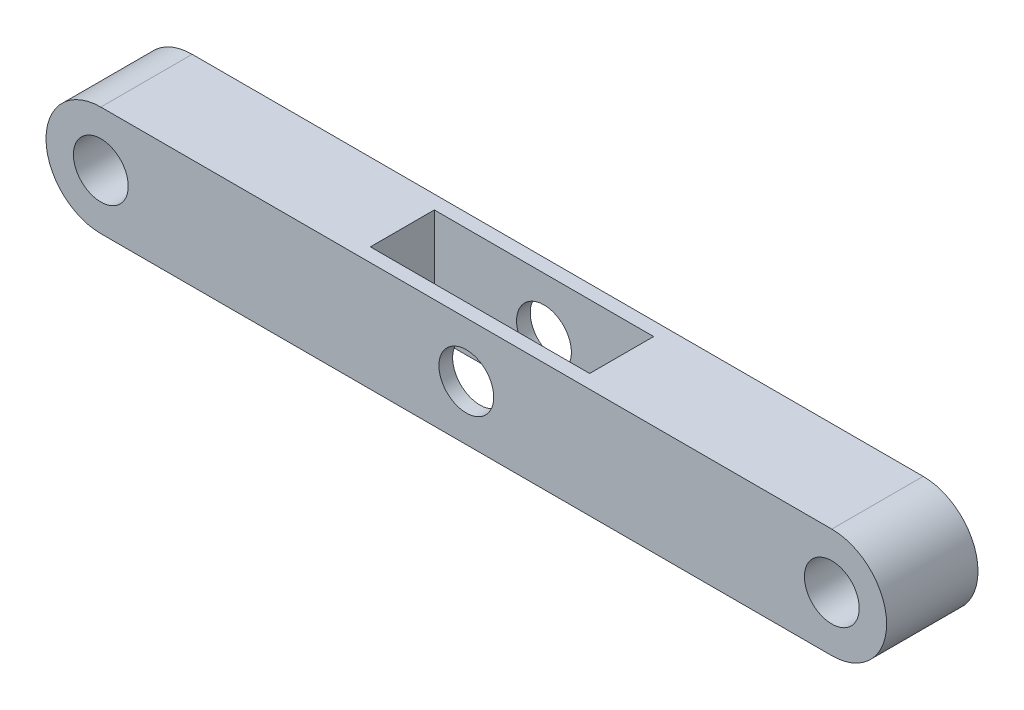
ISO-10303-21;
HEADER;
FILE_DESCRIPTION(('STEP AP214'),'2;1');
FILE_NAME('part.step','',(''),(''),'','','');
FILE_SCHEMA(('AUTOMOTIVE_DESIGN { 1 0 10303 214 1 1 1 1 }'));
ENDSEC;
DATA;
#1=APPLICATION_CONTEXT('core data for automotive mechanical design processes');
#2=APPLICATION_PROTOCOL_DEFINITION('international standard','automotive_design',2000,#1);
#3=PRODUCT_CONTEXT('',#1,'mechanical');
#4=PRODUCT('Part','Part','',(#3));
#5=PRODUCT_RELATED_PRODUCT_CATEGORY('part','',(#4));
#6=PRODUCT_DEFINITION_FORMATION('','',#4);
#7=PRODUCT_DEFINITION_CONTEXT('part definition',#1,'design');
#8=PRODUCT_DEFINITION('design','',#6,#7);
#9=PRODUCT_DEFINITION_SHAPE('','',#8);
#10=(LENGTH_UNIT() NAMED_UNIT(*) SI_UNIT(.MILLI.,.METRE.));
#11=(NAMED_UNIT(*) PLANE_ANGLE_UNIT() SI_UNIT($,.RADIAN.));
#12=(NAMED_UNIT(*) SI_UNIT($,.STERADIAN.) SOLID_ANGLE_UNIT());
#13=UNCERTAINTY_MEASURE_WITH_UNIT(LENGTH_MEASURE(1.E-05),#10,'distance_accuracy_value','');
#14=(GEOMETRIC_REPRESENTATION_CONTEXT(3) GLOBAL_UNCERTAINTY_ASSIGNED_CONTEXT((#13)) GLOBAL_UNIT_ASSIGNED_CONTEXT((#10,
#11,#12)) REPRESENTATION_CONTEXT('',''));
#15=CARTESIAN_POINT('',(0.,0.,0.));
#16=DIRECTION('',(0.,0.,1.));
#17=DIRECTION('',(1.,0.,0.));
#18=AXIS2_PLACEMENT_3D('',#15,#16,#17);
#19=CARTESIAN_POINT('',(0.,0.,5.));
#20=DIRECTION('',(0.,0.,-1.));
#21=DIRECTION('',(-1.,0.,0.));
#22=AXIS2_PLACEMENT_3D('',#19,#20,#21);
#23=PLANE('',#22);
#24=CARTESIAN_POINT('',(40.,0.,5.));
#25=DIRECTION('',(0.,0.,1.));
#26=DIRECTION('',(1.,0.,0.));
#27=AXIS2_PLACEMENT_3D('',#24,#25,#26);
#28=CIRCLE('',#27,3.);
#29=CARTESIAN_POINT('',(43.,0.,5.));
#30=VERTEX_POINT('',#29);
#31=EDGE_CURVE('E252',#30,#30,#28,.T.);
#32=ORIENTED_EDGE('',*,*,#31,.F.);
#33=EDGE_LOOP('',(#32));
#34=FACE_BOUND('',#33,.T.);
#35=CARTESIAN_POINT('',(0.,0.,5.));
#36=DIRECTION('',(0.,0.,1.));
#37=DIRECTION('',(1.,0.,0.));
#38=AXIS2_PLACEMENT_3D('',#35,#36,#37);
#39=CIRCLE('',#38,3.);
#40=CARTESIAN_POINT('',(3.,0.,5.));
#41=VERTEX_POINT('',#40);
#42=EDGE_CURVE('E133',#41,#41,#39,.T.);
#43=ORIENTED_EDGE('',*,*,#42,.F.);
#44=EDGE_LOOP('',(#43));
#45=FACE_BOUND('',#44,.T.);
#46=CARTESIAN_POINT('',(0.,0.,5.));
#47=DIRECTION('',(0.,0.,1.));
#48=DIRECTION('',(-1.,0.,0.));
#49=AXIS2_PLACEMENT_3D('',#46,#47,#48);
#50=CIRCLE('',#49,6.);
#51=CARTESIAN_POINT('',(0.,6.,5.));
#52=VERTEX_POINT('',#51);
#53=CARTESIAN_POINT('',(0.,-6.,5.));
#54=VERTEX_POINT('',#53);
#55=EDGE_CURVE('E145',#52,#54,#50,.T.);
#56=ORIENTED_EDGE('',*,*,#55,.T.);
#57=DIRECTION('',(1.,0.,0.));
#58=VECTOR('',#57,1.);
#59=CARTESIAN_POINT('',(0.,-6.,5.));
#60=LINE('',#59,#58);
#61=CARTESIAN_POINT('',(80.,-6.,5.));
#62=VERTEX_POINT('',#61);
#63=EDGE_CURVE('E148',#54,#62,#60,.T.);
#64=ORIENTED_EDGE('',*,*,#63,.T.);
#65=CARTESIAN_POINT('',(80.,0.,5.));
#66=DIRECTION('',(0.,0.,1.));
#67=DIRECTION('',(1.,0.,0.));
#68=AXIS2_PLACEMENT_3D('',#65,#66,#67);
#69=CIRCLE('',#68,6.);
#70=CARTESIAN_POINT('',(80.,6.,5.));
#71=VERTEX_POINT('',#70);
#72=EDGE_CURVE('E150',#62,#71,#69,.T.);
#73=ORIENTED_EDGE('',*,*,#72,.T.);
#74=DIRECTION('',(-1.,0.,0.));
#75=VECTOR('',#74,1.);
#76=CARTESIAN_POINT('',(0.,6.,5.));
#77=LINE('',#76,#75);
#78=EDGE_CURVE('E152',#71,#52,#77,.T.);
#79=ORIENTED_EDGE('',*,*,#78,.T.);
#80=EDGE_LOOP('',(#56,#64,#73,#79));
#81=FACE_BOUND('',#80,.T.);
#82=CARTESIAN_POINT('',(80.,0.,5.));
#83=DIRECTION('',(0.,0.,1.));
#84=DIRECTION('',(1.,0.,0.));
#85=AXIS2_PLACEMENT_3D('',#82,#83,#84);
#86=CIRCLE('',#85,3.00000000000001);
#87=CARTESIAN_POINT('',(83.,0.,5.));
#88=VERTEX_POINT('',#87);
#89=EDGE_CURVE('E127',#88,#88,#86,.T.);
#90=ORIENTED_EDGE('',*,*,#89,.F.);
#91=EDGE_LOOP('',(#90));
#92=FACE_BOUND('',#91,.T.);
#93=ADVANCED_FACE('F33',(#34,#45,#81,#92),#23,.F.);
#94=CARTESIAN_POINT('',(0.,0.,-5.));
#95=DIRECTION('',(0.,0.,-1.));
#96=DIRECTION('',(-1.,0.,0.));
#97=AXIS2_PLACEMENT_3D('',#94,#95,#96);
#98=PLANE('',#97);
#99=CARTESIAN_POINT('',(40.,0.,-5.));
#100=DIRECTION('',(0.,0.,1.));
#101=DIRECTION('',(1.,0.,0.));
#102=AXIS2_PLACEMENT_3D('',#99,#100,#101);
#103=CIRCLE('',#102,3.);
#104=CARTESIAN_POINT('',(43.,0.,-5.));
#105=VERTEX_POINT('',#104);
#106=EDGE_CURVE('E253',#105,#105,#103,.T.);
#107=ORIENTED_EDGE('',*,*,#106,.T.);
#108=EDGE_LOOP('',(#107));
#109=FACE_BOUND('',#108,.T.);
#110=CARTESIAN_POINT('',(0.,0.,-5.));
#111=DIRECTION('',(0.,0.,1.));
#112=DIRECTION('',(1.,0.,0.));
#113=AXIS2_PLACEMENT_3D('',#110,#111,#112);
#114=CIRCLE('',#113,3.);
#115=CARTESIAN_POINT('',(3.,0.,-5.));
#116=VERTEX_POINT('',#115);
#117=EDGE_CURVE('E130',#116,#116,#114,.T.);
#118=ORIENTED_EDGE('',*,*,#117,.T.);
#119=EDGE_LOOP('',(#118));
#120=FACE_BOUND('',#119,.T.);
#121=CARTESIAN_POINT('',(0.,0.,-5.));
#122=DIRECTION('',(0.,0.,1.));
#123=DIRECTION('',(-1.,0.,0.));
#124=AXIS2_PLACEMENT_3D('',#121,#122,#123);
#125=CIRCLE('',#124,6.);
#126=CARTESIAN_POINT('',(0.,6.,-5.));
#127=VERTEX_POINT('',#126);
#128=CARTESIAN_POINT('',(0.,-6.,-5.));
#129=VERTEX_POINT('',#128);
#130=EDGE_CURVE('E136',#127,#129,#125,.T.);
#131=ORIENTED_EDGE('',*,*,#130,.F.);
#132=DIRECTION('',(-1.,0.,0.));
#133=VECTOR('',#132,1.);
#134=CARTESIAN_POINT('',(0.,6.,-5.));
#135=LINE('',#134,#133);
#136=CARTESIAN_POINT('',(80.,6.,-5.));
#137=VERTEX_POINT('',#136);
#138=EDGE_CURVE('E143',#137,#127,#135,.T.);
#139=ORIENTED_EDGE('',*,*,#138,.F.);
#140=CARTESIAN_POINT('',(80.,0.,-5.));
#141=DIRECTION('',(0.,0.,1.));
#142=DIRECTION('',(1.,0.,0.));
#143=AXIS2_PLACEMENT_3D('',#140,#141,#142);
#144=CIRCLE('',#143,6.);
#145=CARTESIAN_POINT('',(80.,-6.,-5.));
#146=VERTEX_POINT('',#145);
#147=EDGE_CURVE('E141',#146,#137,#144,.T.);
#148=ORIENTED_EDGE('',*,*,#147,.F.);
#149=DIRECTION('',(1.,0.,0.));
#150=VECTOR('',#149,1.);
#151=CARTESIAN_POINT('',(0.,-6.,-5.));
#152=LINE('',#151,#150);
#153=EDGE_CURVE('E139',#129,#146,#152,.T.);
#154=ORIENTED_EDGE('',*,*,#153,.F.);
#155=EDGE_LOOP('',(#131,#139,#148,#154));
#156=FACE_BOUND('',#155,.T.);
#157=CARTESIAN_POINT('',(80.,0.,-5.));
#158=DIRECTION('',(0.,0.,1.));
#159=DIRECTION('',(1.,0.,0.));
#160=AXIS2_PLACEMENT_3D('',#157,#158,#159);
#161=CIRCLE('',#160,3.00000000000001);
#162=CARTESIAN_POINT('',(83.,0.,-5.));
#163=VERTEX_POINT('',#162);
#164=EDGE_CURVE('E124',#163,#163,#161,.T.);
#165=ORIENTED_EDGE('',*,*,#164,.T.);
#166=EDGE_LOOP('',(#165));
#167=FACE_BOUND('',#166,.T.);
#168=ADVANCED_FACE('F170',(#109,#120,#156,#167),#98,.T.);
#169=CARTESIAN_POINT('',(0.,0.,5.));
#170=DIRECTION('',(0.,0.,-1.));
#171=DIRECTION('',(-1.,0.,0.));
#172=AXIS2_PLACEMENT_3D('',#169,#170,#171);
#173=CYLINDRICAL_SURFACE('',#172,6.);
#174=ORIENTED_EDGE('',*,*,#130,.T.);
#175=DIRECTION('',(0.,0.,-1.));
#176=VECTOR('',#175,1.);
#177=CARTESIAN_POINT('',(0.,-6.,5.));
#178=LINE('',#177,#176);
#179=EDGE_CURVE('E11',#54,#129,#178,.T.);
#180=ORIENTED_EDGE('',*,*,#179,.F.);
#181=ORIENTED_EDGE('',*,*,#55,.F.);
#182=DIRECTION('',(0.,0.,-1.));
#183=VECTOR('',#182,1.);
#184=CARTESIAN_POINT('',(0.,6.,5.));
#185=LINE('',#184,#183);
#186=EDGE_CURVE('E154',#52,#127,#185,.T.);
#187=ORIENTED_EDGE('',*,*,#186,.T.);
#188=EDGE_LOOP('',(#174,#180,#181,#187));
#189=FACE_BOUND('',#188,.T.);
#190=ADVANCED_FACE('F35',(#189),#173,.T.);
#191=CARTESIAN_POINT('',(0.,-6.,5.));
#192=DIRECTION('',(0.,1.,0.));
#193=DIRECTION('',(0.,0.,1.));
#194=AXIS2_PLACEMENT_3D('',#191,#192,#193);
#195=PLANE('',#194);
#196=DIRECTION('',(0.,0.,1.));
#197=VECTOR('',#196,1.);
#198=CARTESIAN_POINT('',(52.,-6.,-3.5));
#199=LINE('',#198,#197);
#200=CARTESIAN_POINT('',(52.,-6.,-3.5));
#201=VERTEX_POINT('',#200);
#202=CARTESIAN_POINT('',(52.,-6.,3.5));
#203=VERTEX_POINT('',#202);
#204=EDGE_CURVE('E116',#201,#203,#199,.T.);
#205=ORIENTED_EDGE('',*,*,#204,.F.);
#206=DIRECTION('',(1.,0.,0.));
#207=VECTOR('',#206,1.);
#208=CARTESIAN_POINT('',(28.,-6.,-3.5));
#209=LINE('',#208,#207);
#210=CARTESIAN_POINT('',(28.,-6.,-3.5));
#211=VERTEX_POINT('',#210);
#212=EDGE_CURVE('E115',#211,#201,#209,.T.);
#213=ORIENTED_EDGE('',*,*,#212,.F.);
#214=DIRECTION('',(0.,0.,1.));
#215=VECTOR('',#214,1.);
#216=CARTESIAN_POINT('',(28.,-6.,-3.5));
#217=LINE('',#216,#215);
#218=CARTESIAN_POINT('',(28.,-6.,3.5));
#219=VERTEX_POINT('',#218);
#220=EDGE_CURVE('E104',#211,#219,#217,.T.);
#221=ORIENTED_EDGE('',*,*,#220,.T.);
#222=DIRECTION('',(1.,0.,0.));
#223=VECTOR('',#222,1.);
#224=CARTESIAN_POINT('',(28.,-6.,3.5));
#225=LINE('',#224,#223);
#226=EDGE_CURVE('E96',#219,#203,#225,.T.);
#227=ORIENTED_EDGE('',*,*,#226,.T.);
#228=EDGE_LOOP('',(#205,#213,#221,#227));
#229=FACE_BOUND('',#228,.T.);
#230=ORIENTED_EDGE('',*,*,#153,.T.);
#231=DIRECTION('',(0.,0.,-1.));
#232=VECTOR('',#231,1.);
#233=CARTESIAN_POINT('',(80.,-6.,5.));
#234=LINE('',#233,#232);
#235=EDGE_CURVE('E42',#62,#146,#234,.T.);
#236=ORIENTED_EDGE('',*,*,#235,.F.);
#237=ORIENTED_EDGE('',*,*,#63,.F.);
#238=ORIENTED_EDGE('',*,*,#179,.T.);
#239=EDGE_LOOP('',(#230,#236,#237,#238));
#240=FACE_BOUND('',#239,.T.);
#241=ADVANCED_FACE('F112',(#229,#240),#195,.F.);
#242=CARTESIAN_POINT('',(80.,0.,5.));
#243=DIRECTION('',(0.,0.,-1.));
#244=DIRECTION('',(-1.,0.,0.));
#245=AXIS2_PLACEMENT_3D('',#242,#243,#244);
#246=CYLINDRICAL_SURFACE('',#245,6.);
#247=ORIENTED_EDGE('',*,*,#147,.T.);
#248=DIRECTION('',(0.,0.,-1.));
#249=VECTOR('',#248,1.);
#250=CARTESIAN_POINT('',(80.,6.,5.));
#251=LINE('',#250,#249);
#252=EDGE_CURVE('E157',#71,#137,#251,.T.);
#253=ORIENTED_EDGE('',*,*,#252,.F.);
#254=ORIENTED_EDGE('',*,*,#72,.F.);
#255=ORIENTED_EDGE('',*,*,#235,.T.);
#256=EDGE_LOOP('',(#247,#253,#254,#255));
#257=FACE_BOUND('',#256,.T.);
#258=ADVANCED_FACE('F165',(#257),#246,.T.);
#259=CARTESIAN_POINT('',(0.,6.,5.));
#260=DIRECTION('',(0.,-1.,0.));
#261=DIRECTION('',(0.,0.,-1.));
#262=AXIS2_PLACEMENT_3D('',#259,#260,#261);
#263=PLANE('',#262);
#264=DIRECTION('',(0.,0.,1.));
#265=VECTOR('',#264,1.);
#266=CARTESIAN_POINT('',(28.,6.00000000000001,-3.5));
#267=LINE('',#266,#265);
#268=CARTESIAN_POINT('',(28.,6.00000000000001,-3.5));
#269=VERTEX_POINT('',#268);
#270=CARTESIAN_POINT('',(28.,6.,3.5));
#271=VERTEX_POINT('',#270);
#272=EDGE_CURVE('E107',#269,#271,#267,.T.);
#273=ORIENTED_EDGE('',*,*,#272,.F.);
#274=DIRECTION('',(-1.,0.,0.));
#275=VECTOR('',#274,1.);
#276=CARTESIAN_POINT('',(28.,6.00000000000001,-3.5));
#277=LINE('',#276,#275);
#278=CARTESIAN_POINT('',(52.,6.00000000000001,-3.5));
#279=VERTEX_POINT('',#278);
#280=EDGE_CURVE('E210',#279,#269,#277,.T.);
#281=ORIENTED_EDGE('',*,*,#280,.F.);
#282=DIRECTION('',(0.,0.,1.));
#283=VECTOR('',#282,1.);
#284=CARTESIAN_POINT('',(52.,6.00000000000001,-3.5));
#285=LINE('',#284,#283);
#286=CARTESIAN_POINT('',(52.,6.00000000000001,3.5));
#287=VERTEX_POINT('',#286);
#288=EDGE_CURVE('E118',#279,#287,#285,.T.);
#289=ORIENTED_EDGE('',*,*,#288,.T.);
#290=DIRECTION('',(-1.,0.,0.));
#291=VECTOR('',#290,1.);
#292=CARTESIAN_POINT('',(40.,6.,3.5));
#293=LINE('',#292,#291);
#294=EDGE_CURVE('E211',#287,#271,#293,.T.);
#295=ORIENTED_EDGE('',*,*,#294,.T.);
#296=EDGE_LOOP('',(#273,#281,#289,#295));
#297=FACE_BOUND('',#296,.T.);
#298=ORIENTED_EDGE('',*,*,#138,.T.);
#299=ORIENTED_EDGE('',*,*,#186,.F.);
#300=ORIENTED_EDGE('',*,*,#78,.F.);
#301=ORIENTED_EDGE('',*,*,#252,.T.);
#302=EDGE_LOOP('',(#298,#299,#300,#301));
#303=FACE_BOUND('',#302,.T.);
#304=ADVANCED_FACE('F174',(#297,#303),#263,.F.);
#305=CARTESIAN_POINT('',(0.,0.,5.));
#306=DIRECTION('',(0.,0.,-1.));
#307=DIRECTION('',(-1.,0.,0.));
#308=AXIS2_PLACEMENT_3D('',#305,#306,#307);
#309=CYLINDRICAL_SURFACE('',#308,3.);
#310=ORIENTED_EDGE('',*,*,#42,.T.);
#311=EDGE_LOOP('',(#310));
#312=FACE_BOUND('',#311,.T.);
#313=ORIENTED_EDGE('',*,*,#117,.F.);
#314=EDGE_LOOP('',(#313));
#315=FACE_BOUND('',#314,.T.);
#316=ADVANCED_FACE('F200',(#312,#315),#309,.F.);
#317=CARTESIAN_POINT('',(80.,0.,5.));
#318=DIRECTION('',(0.,0.,-1.));
#319=DIRECTION('',(-1.,0.,0.));
#320=AXIS2_PLACEMENT_3D('',#317,#318,#319);
#321=CYLINDRICAL_SURFACE('',#320,3.00000000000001);
#322=ORIENTED_EDGE('',*,*,#89,.T.);
#323=EDGE_LOOP('',(#322));
#324=FACE_BOUND('',#323,.T.);
#325=ORIENTED_EDGE('',*,*,#164,.F.);
#326=EDGE_LOOP('',(#325));
#327=FACE_BOUND('',#326,.T.);
#328=ADVANCED_FACE('F205',(#324,#327),#321,.F.);
#329=CARTESIAN_POINT('',(52.,6.00000000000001,-3.5));
#330=DIRECTION('',(1.,0.,0.));
#331=DIRECTION('',(0.,0.,-1.));
#332=AXIS2_PLACEMENT_3D('',#329,#330,#331);
#333=PLANE('',#332);
#334=DIRECTION('',(0.,1.,0.));
#335=VECTOR('',#334,1.);
#336=CARTESIAN_POINT('',(52.,6.00000000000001,3.5));
#337=LINE('',#336,#335);
#338=EDGE_CURVE('E49',#203,#287,#337,.T.);
#339=ORIENTED_EDGE('',*,*,#338,.T.);
#340=ORIENTED_EDGE('',*,*,#288,.F.);
#341=DIRECTION('',(0.,1.,0.));
#342=VECTOR('',#341,1.);
#343=CARTESIAN_POINT('',(52.,6.00000000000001,-3.5));
#344=LINE('',#343,#342);
#345=EDGE_CURVE('E120',#201,#279,#344,.T.);
#346=ORIENTED_EDGE('',*,*,#345,.F.);
#347=ORIENTED_EDGE('',*,*,#204,.T.);
#348=EDGE_LOOP('',(#339,#340,#346,#347));
#349=FACE_BOUND('',#348,.T.);
#350=ADVANCED_FACE('F223',(#349),#333,.F.);
#351=CARTESIAN_POINT('',(28.,-6.,-3.5));
#352=DIRECTION('',(-1.,0.,0.));
#353=DIRECTION('',(0.,0.,1.));
#354=AXIS2_PLACEMENT_3D('',#351,#352,#353);
#355=PLANE('',#354);
#356=DIRECTION('',(0.,-1.,0.));
#357=VECTOR('',#356,1.);
#358=CARTESIAN_POINT('',(28.,-6.,3.5));
#359=LINE('',#358,#357);
#360=EDGE_CURVE('E54',#271,#219,#359,.T.);
#361=ORIENTED_EDGE('',*,*,#360,.T.);
#362=ORIENTED_EDGE('',*,*,#220,.F.);
#363=DIRECTION('',(0.,-1.,0.));
#364=VECTOR('',#363,1.);
#365=CARTESIAN_POINT('',(28.,-6.,-3.5));
#366=LINE('',#365,#364);
#367=EDGE_CURVE('E213',#269,#211,#366,.T.);
#368=ORIENTED_EDGE('',*,*,#367,.F.);
#369=ORIENTED_EDGE('',*,*,#272,.T.);
#370=EDGE_LOOP('',(#361,#362,#368,#369));
#371=FACE_BOUND('',#370,.T.);
#372=ADVANCED_FACE('F103',(#371),#355,.F.);
#373=CARTESIAN_POINT('',(52.,5.99999999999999,-3.5));
#374=DIRECTION('',(0.,0.,-1.));
#375=DIRECTION('',(-1.,0.,0.));
#376=AXIS2_PLACEMENT_3D('',#373,#374,#375);
#377=PLANE('',#376);
#378=CARTESIAN_POINT('',(40.,0.,-3.5));
#379=DIRECTION('',(0.,0.,-1.));
#380=DIRECTION('',(-1.,0.,0.));
#381=AXIS2_PLACEMENT_3D('',#378,#379,#380);
#382=CIRCLE('',#381,3.);
#383=CARTESIAN_POINT('',(37.,0.,-3.5));
#384=VERTEX_POINT('',#383);
#385=EDGE_CURVE('E109',#384,#384,#382,.T.);
#386=ORIENTED_EDGE('',*,*,#385,.T.);
#387=EDGE_LOOP('',(#386));
#388=FACE_BOUND('',#387,.T.);
#389=ORIENTED_EDGE('',*,*,#280,.T.);
#390=ORIENTED_EDGE('',*,*,#367,.T.);
#391=ORIENTED_EDGE('',*,*,#212,.T.);
#392=ORIENTED_EDGE('',*,*,#345,.T.);
#393=EDGE_LOOP('',(#389,#390,#391,#392));
#394=FACE_BOUND('',#393,.T.);
#395=ADVANCED_FACE('F221',(#388,#394),#377,.F.);
#396=CARTESIAN_POINT('',(52.,5.99999999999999,3.5));
#397=DIRECTION('',(0.,0.,-1.));
#398=DIRECTION('',(-1.,0.,0.));
#399=AXIS2_PLACEMENT_3D('',#396,#397,#398);
#400=PLANE('',#399);
#401=CARTESIAN_POINT('',(40.,0.,3.5));
#402=DIRECTION('',(0.,0.,-1.));
#403=DIRECTION('',(-1.,0.,0.));
#404=AXIS2_PLACEMENT_3D('',#401,#402,#403);
#405=CIRCLE('',#404,3.);
#406=CARTESIAN_POINT('',(37.,0.,3.5));
#407=VERTEX_POINT('',#406);
#408=EDGE_CURVE('E37',#407,#407,#405,.T.);
#409=ORIENTED_EDGE('',*,*,#408,.F.);
#410=EDGE_LOOP('',(#409));
#411=FACE_BOUND('',#410,.T.);
#412=ORIENTED_EDGE('',*,*,#294,.F.);
#413=ORIENTED_EDGE('',*,*,#338,.F.);
#414=ORIENTED_EDGE('',*,*,#226,.F.);
#415=ORIENTED_EDGE('',*,*,#360,.F.);
#416=EDGE_LOOP('',(#412,#413,#414,#415));
#417=FACE_BOUND('',#416,.T.);
#418=ADVANCED_FACE('F97',(#411,#417),#400,.T.);
#419=CARTESIAN_POINT('',(40.,0.,-5.));
#420=DIRECTION('',(0.,0.,1.));
#421=DIRECTION('',(1.,0.,0.));
#422=AXIS2_PLACEMENT_3D('',#419,#420,#421);
#423=CYLINDRICAL_SURFACE('',#422,3.);
#424=ORIENTED_EDGE('',*,*,#408,.T.);
#425=EDGE_LOOP('',(#424));
#426=FACE_BOUND('',#425,.T.);
#427=ORIENTED_EDGE('',*,*,#31,.T.);
#428=EDGE_LOOP('',(#427));
#429=FACE_BOUND('',#428,.T.);
#430=ADVANCED_FACE('F239',(#426,#429),#423,.F.);
#431=ORIENTED_EDGE('',*,*,#106,.F.);
#432=EDGE_LOOP('',(#431));
#433=FACE_BOUND('',#432,.T.);
#434=ORIENTED_EDGE('',*,*,#385,.F.);
#435=EDGE_LOOP('',(#434));
#436=FACE_BOUND('',#435,.T.);
#437=ADVANCED_FACE('F242',(#433,#436),#423,.F.);
#438=CLOSED_SHELL('',(#93,#168,#190,#241,#258,#304,#316,#328,#350,#372,#395,#418,#430,#437));
#439=MANIFOLD_SOLID_BREP('B2',#438);
#440=ADVANCED_BREP_SHAPE_REPRESENTATION('',(#18,#439),#14);
#441=SHAPE_DEFINITION_REPRESENTATION(#9,#440);
ENDSEC;
END-ISO-10303-21;
